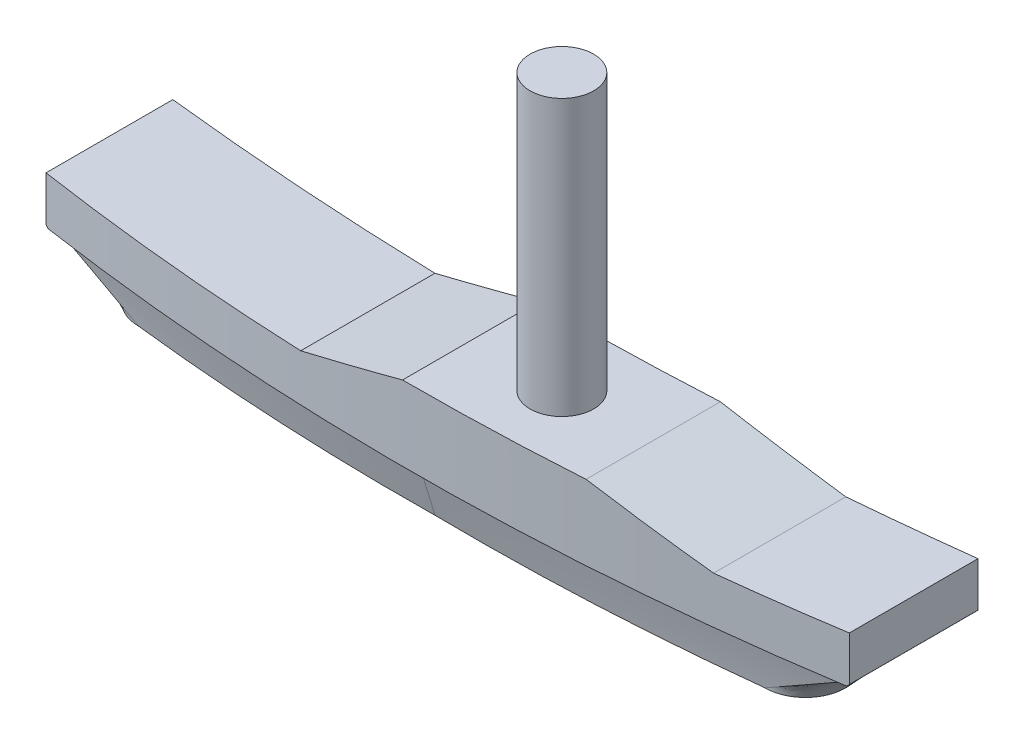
ISO-10303-21;
HEADER;
FILE_DESCRIPTION(('STEP AP214'),'2;1');
FILE_NAME('part.step','',(''),(''),'','','');
FILE_SCHEMA(('AUTOMOTIVE_DESIGN { 1 0 10303 214 1 1 1 1 }'));
ENDSEC;
DATA;
#1=APPLICATION_CONTEXT('core data for automotive mechanical design processes');
#2=APPLICATION_PROTOCOL_DEFINITION('international standard','automotive_design',2000,#1);
#3=PRODUCT_CONTEXT('',#1,'mechanical');
#4=PRODUCT('Part','Part','',(#3));
#5=PRODUCT_RELATED_PRODUCT_CATEGORY('part','',(#4));
#6=PRODUCT_DEFINITION_FORMATION('','',#4);
#7=PRODUCT_DEFINITION_CONTEXT('part definition',#1,'design');
#8=PRODUCT_DEFINITION('design','',#6,#7);
#9=PRODUCT_DEFINITION_SHAPE('','',#8);
#10=(LENGTH_UNIT() NAMED_UNIT(*) SI_UNIT(.MILLI.,.METRE.));
#11=(NAMED_UNIT(*) PLANE_ANGLE_UNIT() SI_UNIT($,.RADIAN.));
#12=(NAMED_UNIT(*) SI_UNIT($,.STERADIAN.) SOLID_ANGLE_UNIT());
#13=UNCERTAINTY_MEASURE_WITH_UNIT(LENGTH_MEASURE(1.E-05),#10,'distance_accuracy_value','');
#14=(GEOMETRIC_REPRESENTATION_CONTEXT(3) GLOBAL_UNCERTAINTY_ASSIGNED_CONTEXT((#13)) GLOBAL_UNIT_ASSIGNED_CONTEXT((#10,
#11,#12)) REPRESENTATION_CONTEXT('',''));
#15=CARTESIAN_POINT('',(0.,0.,0.));
#16=DIRECTION('',(0.,0.,1.));
#17=DIRECTION('',(1.,0.,0.));
#18=AXIS2_PLACEMENT_3D('',#15,#16,#17);
#19=CARTESIAN_POINT('',(89.4617446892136,128.447272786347,-41.));
#20=DIRECTION('',(0.,1.,0.));
#21=DIRECTION('',(0.,0.,1.));
#22=AXIS2_PLACEMENT_3D('',#19,#20,#21);
#23=PLANE('',#22);
#24=DIRECTION('',(0.,0.,1.));
#25=VECTOR('',#24,1.);
#26=CARTESIAN_POINT('',(89.4617446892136,128.447272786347,-41.));
#27=LINE('',#26,#25);
#28=CARTESIAN_POINT('',(89.4617446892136,128.447272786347,-34.2392456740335));
#29=VERTEX_POINT('',#28);
#30=CARTESIAN_POINT('',(89.4617446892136,128.447272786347,-9.71667776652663));
#31=VERTEX_POINT('',#30);
#32=EDGE_CURVE('E258',#29,#31,#27,.T.);
#33=ORIENTED_EDGE('',*,*,#32,.T.);
#34=CARTESIAN_POINT('',(90.2256837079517,128.447272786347,-487.581419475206));
#35=DIRECTION('',(0.,1.,0.));
#36=DIRECTION('',(0.,0.,1.));
#37=AXIS2_PLACEMENT_3D('',#34,#35,#36);
#38=CIRCLE('',#37,477.865352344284);
#39=CARTESIAN_POINT('',(121.725900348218,128.447272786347,-10.7554225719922));
#40=VERTEX_POINT('',#39);
#41=EDGE_CURVE('E228',#40,#31,#38,.F.);
#42=ORIENTED_EDGE('',*,*,#41,.F.);
#43=DIRECTION('',(0.,0.,1.));
#44=VECTOR('',#43,1.);
#45=CARTESIAN_POINT('',(121.725900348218,128.447272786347,-41.));
#46=LINE('',#45,#44);
#47=CARTESIAN_POINT('',(121.725900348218,128.447272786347,-35.1330182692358));
#48=VERTEX_POINT('',#47);
#49=EDGE_CURVE('E261',#48,#40,#46,.T.);
#50=ORIENTED_EDGE('',*,*,#49,.F.);
#51=CARTESIAN_POINT('',(88.1460786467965,128.447272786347,-664.5294804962));
#52=DIRECTION('',(0.,1.,0.));
#53=DIRECTION('',(0.,0.,1.));
#54=AXIS2_PLACEMENT_3D('',#51,#52,#53);
#55=CIRCLE('',#54,630.291607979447);
#56=EDGE_CURVE('E246',#29,#48,#55,.T.);
#57=ORIENTED_EDGE('',*,*,#56,.F.);
#58=EDGE_LOOP('',(#33,#42,#50,#57));
#59=FACE_BOUND('',#58,.T.);
#60=CARTESIAN_POINT('',(105.593822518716,128.447272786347,-22.4973341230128));
#61=DIRECTION('',(0.,1.,0.));
#62=DIRECTION('',(0.,0.,1.));
#63=AXIS2_PLACEMENT_3D('',#60,#61,#62);
#64=CIRCLE('',#63,5.77113497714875);
#65=CARTESIAN_POINT('',(105.593822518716,128.447272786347,-16.7261991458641));
#66=VERTEX_POINT('',#65);
#67=EDGE_CURVE('E547',#66,#66,#64,.T.);
#68=ORIENTED_EDGE('',*,*,#67,.F.);
#69=EDGE_LOOP('',(#68));
#70=FACE_BOUND('',#69,.T.);
#71=ADVANCED_FACE('F38',(#59,#70),#23,.T.);
#72=CARTESIAN_POINT('',(28.1748364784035,106.857743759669,-40.));
#73=DIRECTION('',(-0.697545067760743,-0.716540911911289,0.));
#74=DIRECTION('',(0.716540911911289,-0.697545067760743,0.));
#75=AXIS2_PLACEMENT_3D('',#72,#73,#74);
#76=PLANE('',#75);
#77=DIRECTION('',(0.,0.,-1.));
#78=VECTOR('',#77,1.);
#79=CARTESIAN_POINT('',(19.956977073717,114.857743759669,-40.));
#80=LINE('',#79,#78);
#81=CARTESIAN_POINT('',(19.956977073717,114.857743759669,-14.9107055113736));
#82=VERTEX_POINT('',#81);
#83=CARTESIAN_POINT('',(19.956977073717,114.857743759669,-37.9373025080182));
#84=VERTEX_POINT('',#83);
#85=EDGE_CURVE('E206',#82,#84,#80,.T.);
#86=ORIENTED_EDGE('',*,*,#85,.F.);
#87=CARTESIAN_POINT('',(90.2256837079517,46.4518943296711,-487.581419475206));
#88=DIRECTION('',(-0.697545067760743,-0.716540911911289,0.));
#89=DIRECTION('',(0.716540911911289,-0.697545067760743,0.));
#90=AXIS2_PLACEMENT_3D('',#87,#88,#89);
#91=ELLIPSE('',#90,666.905886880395,477.865352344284);
#92=CARTESIAN_POINT('',(19.503823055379,115.298884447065,-14.9782948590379));
#93=VERTEX_POINT('',#92);
#94=EDGE_CURVE('E217',#93,#82,#91,.F.);
#95=ORIENTED_EDGE('',*,*,#94,.F.);
#96=DIRECTION('',(0.,0.,1.));
#97=VECTOR('',#96,1.);
#98=CARTESIAN_POINT('',(19.503823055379,115.298884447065,-40.));
#99=LINE('',#98,#97);
#100=CARTESIAN_POINT('',(19.503823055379,115.298884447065,-37.9867829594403));
#101=VERTEX_POINT('',#100);
#102=EDGE_CURVE('E46',#101,#93,#99,.T.);
#103=ORIENTED_EDGE('',*,*,#102,.F.);
#104=CARTESIAN_POINT('',(88.1460786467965,48.4763680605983,-664.5294804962));
#105=DIRECTION('',(-0.697545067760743,-0.716540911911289,0.));
#106=DIRECTION('',(0.716540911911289,-0.697545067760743,0.));
#107=AXIS2_PLACEMENT_3D('',#104,#105,#106);
#108=ELLIPSE('',#107,879.631012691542,630.291607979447);
#109=EDGE_CURVE('E215',#84,#101,#108,.T.);
#110=ORIENTED_EDGE('',*,*,#109,.F.);
#111=EDGE_LOOP('',(#86,#95,#103,#110));
#112=FACE_BOUND('',#111,.T.);
#113=ADVANCED_FACE('F40',(#112),#76,.T.);
#114=CARTESIAN_POINT('',(164.696110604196,115.298884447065,-40.));
#115=DIRECTION('',(0.716540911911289,-0.697545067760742,0.));
#116=DIRECTION('',(0.697545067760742,0.716540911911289,0.));
#117=AXIS2_PLACEMENT_3D('',#114,#115,#116);
#118=PLANE('',#117);
#119=DIRECTION('',(0.,0.,1.));
#120=VECTOR('',#119,1.);
#121=CARTESIAN_POINT('',(164.266664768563,114.857743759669,-40.));
#122=LINE('',#121,#120);
#123=CARTESIAN_POINT('',(164.266664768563,114.857743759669,-38.8513144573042));
#124=VERTEX_POINT('',#123);
#125=CARTESIAN_POINT('',(164.266664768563,114.857743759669,-15.4869076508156));
#126=VERTEX_POINT('',#125);
#127=EDGE_CURVE('E60',#124,#126,#122,.T.);
#128=ORIENTED_EDGE('',*,*,#127,.F.);
#129=CARTESIAN_POINT('',(88.1460786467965,36.6642094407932,-664.5294804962));
#130=DIRECTION('',(0.716540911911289,-0.697545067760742,0.));
#131=DIRECTION('',(-0.697545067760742,-0.716540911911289,0.));
#132=AXIS2_PLACEMENT_3D('',#129,#130,#131);
#133=ELLIPSE('',#132,903.585498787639,630.291607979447);
#134=CARTESIAN_POINT('',(164.696110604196,115.298884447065,-38.9037108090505));
#135=VERTEX_POINT('',#134);
#136=EDGE_CURVE('E210',#135,#124,#133,.T.);
#137=ORIENTED_EDGE('',*,*,#136,.F.);
#138=DIRECTION('',(0.,0.,1.));
#139=VECTOR('',#138,1.);
#140=CARTESIAN_POINT('',(164.696110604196,115.298884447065,-40.));
#141=LINE('',#140,#139);
#142=CARTESIAN_POINT('',(164.696110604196,115.298884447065,-15.5544599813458));
#143=VERTEX_POINT('',#142);
#144=EDGE_CURVE('E254',#135,#143,#141,.T.);
#145=ORIENTED_EDGE('',*,*,#144,.T.);
#146=CARTESIAN_POINT('',(90.2256837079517,38.8004471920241,-487.581419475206));
#147=DIRECTION('',(0.716540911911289,-0.697545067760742,0.));
#148=DIRECTION('',(-0.697545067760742,-0.716540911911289,0.));
#149=AXIS2_PLACEMENT_3D('',#146,#147,#148);
#150=ELLIPSE('',#149,685.067351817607,477.865352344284);
#151=EDGE_CURVE('E213',#126,#143,#150,.F.);
#152=ORIENTED_EDGE('',*,*,#151,.F.);
#153=EDGE_LOOP('',(#128,#137,#145,#152));
#154=FACE_BOUND('',#153,.T.);
#155=ADVANCED_FACE('F279',(#154),#118,.T.);
#156=CARTESIAN_POINT('',(164.696110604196,123.392059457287,-41.));
#157=DIRECTION('',(1.,0.,0.));
#158=DIRECTION('',(0.,0.,-1.));
#159=AXIS2_PLACEMENT_3D('',#156,#157,#158);
#160=PLANE('',#159);
#161=DIRECTION('',(0.,0.,1.));
#162=VECTOR('',#161,1.);
#163=CARTESIAN_POINT('',(164.696110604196,123.392059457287,-41.));
#164=LINE('',#163,#162);
#165=CARTESIAN_POINT('',(164.696110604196,123.392059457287,-38.9037108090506));
#166=VERTEX_POINT('',#165);
#167=CARTESIAN_POINT('',(164.696110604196,123.392059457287,-15.5544599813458));
#168=VERTEX_POINT('',#167);
#169=EDGE_CURVE('E250',#166,#168,#164,.T.);
#170=ORIENTED_EDGE('',*,*,#169,.T.);
#171=DIRECTION('',(0.,-1.,0.));
#172=VECTOR('',#171,1.);
#173=CARTESIAN_POINT('',(164.696110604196,128.448272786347,-15.5544599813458));
#174=LINE('',#173,#172);
#175=EDGE_CURVE('E233',#168,#143,#174,.T.);
#176=ORIENTED_EDGE('',*,*,#175,.T.);
#177=ORIENTED_EDGE('',*,*,#144,.F.);
#178=DIRECTION('',(0.,-1.,0.));
#179=VECTOR('',#178,1.);
#180=CARTESIAN_POINT('',(164.696110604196,128.448272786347,-38.9037108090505));
#181=LINE('',#180,#179);
#182=EDGE_CURVE('E237',#166,#135,#181,.T.);
#183=ORIENTED_EDGE('',*,*,#182,.F.);
#184=EDGE_LOOP('',(#170,#176,#177,#183));
#185=FACE_BOUND('',#184,.T.);
#186=ADVANCED_FACE('F282',(#185),#160,.T.);
#187=CARTESIAN_POINT('',(19.503823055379,115.298884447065,-41.));
#188=DIRECTION('',(-1.,0.,0.));
#189=DIRECTION('',(0.,-1.,0.));
#190=AXIS2_PLACEMENT_3D('',#187,#188,#189);
#191=PLANE('',#190);
#192=ORIENTED_EDGE('',*,*,#102,.T.);
#193=DIRECTION('',(0.,-1.,0.));
#194=VECTOR('',#193,1.);
#195=CARTESIAN_POINT('',(19.503823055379,128.448272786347,-14.9782948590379));
#196=LINE('',#195,#194);
#197=CARTESIAN_POINT('',(19.503823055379,123.392059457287,-14.9782948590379));
#198=VERTEX_POINT('',#197);
#199=EDGE_CURVE('E232',#198,#93,#196,.T.);
#200=ORIENTED_EDGE('',*,*,#199,.F.);
#201=DIRECTION('',(0.,0.,1.));
#202=VECTOR('',#201,1.);
#203=CARTESIAN_POINT('',(19.503823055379,123.392059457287,-41.));
#204=LINE('',#203,#202);
#205=CARTESIAN_POINT('',(19.503823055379,123.392059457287,-37.9867829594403));
#206=VERTEX_POINT('',#205);
#207=EDGE_CURVE('E251',#206,#198,#204,.T.);
#208=ORIENTED_EDGE('',*,*,#207,.F.);
#209=DIRECTION('',(0.,-1.,0.));
#210=VECTOR('',#209,1.);
#211=CARTESIAN_POINT('',(19.503823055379,128.448272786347,-37.9867829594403));
#212=LINE('',#211,#210);
#213=EDGE_CURVE('E239',#206,#101,#212,.T.);
#214=ORIENTED_EDGE('',*,*,#213,.T.);
#215=EDGE_LOOP('',(#192,#200,#208,#214));
#216=FACE_BOUND('',#215,.T.);
#217=ADVANCED_FACE('F313',(#216),#191,.T.);
#218=CARTESIAN_POINT('',(19.503823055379,123.392059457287,-41.));
#219=DIRECTION('',(0.,1.,0.));
#220=DIRECTION('',(0.,0.,1.));
#221=AXIS2_PLACEMENT_3D('',#218,#219,#220);
#222=PLANE('',#221);
#223=ORIENTED_EDGE('',*,*,#207,.T.);
#224=CARTESIAN_POINT('',(90.2256837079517,123.392059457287,-487.581419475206));
#225=DIRECTION('',(0.,1.,0.));
#226=DIRECTION('',(0.,0.,1.));
#227=AXIS2_PLACEMENT_3D('',#224,#225,#226);
#228=CIRCLE('',#227,477.865352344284);
#229=CARTESIAN_POINT('',(70.5790360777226,123.392059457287,-10.1201077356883));
#230=VERTEX_POINT('',#229);
#231=EDGE_CURVE('E222',#230,#198,#228,.F.);
#232=ORIENTED_EDGE('',*,*,#231,.F.);
#233=DIRECTION('',(0.,0.,1.));
#234=VECTOR('',#233,1.);
#235=CARTESIAN_POINT('',(70.5790360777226,123.392059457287,-41.));
#236=LINE('',#235,#234);
#237=CARTESIAN_POINT('',(70.5790360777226,123.392059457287,-34.482728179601));
#238=VERTEX_POINT('',#237);
#239=EDGE_CURVE('E255',#238,#230,#236,.T.);
#240=ORIENTED_EDGE('',*,*,#239,.F.);
#241=CARTESIAN_POINT('',(88.1460786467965,123.392059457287,-664.5294804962));
#242=DIRECTION('',(0.,1.,0.));
#243=DIRECTION('',(0.,0.,1.));
#244=AXIS2_PLACEMENT_3D('',#241,#242,#243);
#245=CIRCLE('',#244,630.291607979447);
#246=EDGE_CURVE('E220',#206,#238,#245,.T.);
#247=ORIENTED_EDGE('',*,*,#246,.F.);
#248=EDGE_LOOP('',(#223,#232,#240,#247));
#249=FACE_BOUND('',#248,.T.);
#250=ADVANCED_FACE('F309',(#249),#222,.T.);
#251=CARTESIAN_POINT('',(70.5790360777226,123.392059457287,-41.));
#252=DIRECTION('',(-0.25860935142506,0.965981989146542,0.));
#253=DIRECTION('',(-0.965981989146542,-0.25860935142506,0.));
#254=AXIS2_PLACEMENT_3D('',#251,#252,#253);
#255=PLANE('',#254);
#256=ORIENTED_EDGE('',*,*,#239,.T.);
#257=CARTESIAN_POINT('',(90.2256837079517,128.651791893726,-487.581419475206));
#258=DIRECTION('',(-0.25860935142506,0.965981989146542,0.));
#259=DIRECTION('',(-0.965981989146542,-0.25860935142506,0.));
#260=AXIS2_PLACEMENT_3D('',#257,#258,#259);
#261=ELLIPSE('',#260,494.693853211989,477.865352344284);
#262=EDGE_CURVE('E230',#31,#230,#261,.F.);
#263=ORIENTED_EDGE('',*,*,#262,.F.);
#264=ORIENTED_EDGE('',*,*,#32,.F.);
#265=CARTESIAN_POINT('',(88.1460786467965,128.095047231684,-664.5294804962));
#266=DIRECTION('',(-0.25860935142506,0.965981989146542,0.));
#267=DIRECTION('',(-0.965981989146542,-0.25860935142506,0.));
#268=AXIS2_PLACEMENT_3D('',#265,#266,#267);
#269=ELLIPSE('',#268,652.48795014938,630.291607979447);
#270=EDGE_CURVE('E248',#238,#29,#269,.T.);
#271=ORIENTED_EDGE('',*,*,#270,.F.);
#272=EDGE_LOOP('',(#256,#263,#264,#271));
#273=FACE_BOUND('',#272,.T.);
#274=ADVANCED_FACE('F304',(#273),#255,.T.);
#275=CARTESIAN_POINT('',(121.725900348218,128.447272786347,-41.));
#276=DIRECTION('',(0.231313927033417,0.972879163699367,0.));
#277=DIRECTION('',(-0.972879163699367,0.231313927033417,0.));
#278=AXIS2_PLACEMENT_3D('',#275,#276,#277);
#279=PLANE('',#278);
#280=ORIENTED_EDGE('',*,*,#49,.T.);
#281=CARTESIAN_POINT('',(90.2256837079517,135.936834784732,-487.581419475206));
#282=DIRECTION('',(0.231313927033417,0.972879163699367,0.));
#283=DIRECTION('',(0.972879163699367,-0.231313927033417,0.));
#284=AXIS2_PLACEMENT_3D('',#281,#282,#283);
#285=ELLIPSE('',#284,491.186747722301,477.865352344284);
#286=CARTESIAN_POINT('',(142.987532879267,123.392059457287,-12.6377572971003));
#287=VERTEX_POINT('',#286);
#288=EDGE_CURVE('E226',#287,#40,#285,.F.);
#289=ORIENTED_EDGE('',*,*,#288,.F.);
#290=DIRECTION('',(0.,0.,1.));
#291=VECTOR('',#290,1.);
#292=CARTESIAN_POINT('',(142.987532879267,123.392059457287,-41.));
#293=LINE('',#292,#291);
#294=CARTESIAN_POINT('',(142.987532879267,123.392059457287,-36.628273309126));
#295=VERTEX_POINT('',#294);
#296=EDGE_CURVE('E264',#295,#287,#293,.T.);
#297=ORIENTED_EDGE('',*,*,#296,.F.);
#298=CARTESIAN_POINT('',(88.1460786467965,136.431286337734,-664.5294804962));
#299=DIRECTION('',(0.231313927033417,0.972879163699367,0.));
#300=DIRECTION('',(0.972879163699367,-0.231313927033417,0.));
#301=AXIS2_PLACEMENT_3D('',#298,#299,#300);
#302=ELLIPSE('',#301,647.862171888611,630.291607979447);
#303=EDGE_CURVE('E244',#48,#295,#302,.T.);
#304=ORIENTED_EDGE('',*,*,#303,.F.);
#305=EDGE_LOOP('',(#280,#289,#297,#304));
#306=FACE_BOUND('',#305,.T.);
#307=ADVANCED_FACE('F294',(#306),#279,.T.);
#308=CARTESIAN_POINT('',(142.987532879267,123.392059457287,-41.));
#309=DIRECTION('',(0.,1.,0.));
#310=DIRECTION('',(0.,0.,1.));
#311=AXIS2_PLACEMENT_3D('',#308,#309,#310);
#312=PLANE('',#311);
#313=ORIENTED_EDGE('',*,*,#296,.T.);
#314=CARTESIAN_POINT('',(90.2256837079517,123.392059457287,-487.581419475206));
#315=DIRECTION('',(0.,1.,0.));
#316=DIRECTION('',(0.,0.,1.));
#317=AXIS2_PLACEMENT_3D('',#314,#315,#316);
#318=CIRCLE('',#317,477.865352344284);
#319=EDGE_CURVE('E224',#168,#287,#318,.F.);
#320=ORIENTED_EDGE('',*,*,#319,.F.);
#321=ORIENTED_EDGE('',*,*,#169,.F.);
#322=CARTESIAN_POINT('',(88.1460786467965,123.392059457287,-664.5294804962));
#323=DIRECTION('',(0.,1.,0.));
#324=DIRECTION('',(0.,0.,1.));
#325=AXIS2_PLACEMENT_3D('',#322,#323,#324);
#326=CIRCLE('',#325,630.291607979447);
#327=EDGE_CURVE('E236',#295,#166,#326,.T.);
#328=ORIENTED_EDGE('',*,*,#327,.F.);
#329=EDGE_LOOP('',(#313,#320,#321,#328));
#330=FACE_BOUND('',#329,.T.);
#331=ADVANCED_FACE('F289',(#330),#312,.T.);
#332=CARTESIAN_POINT('',(88.1460786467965,128.448272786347,-664.5294804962));
#333=DIRECTION('',(0.,-1.,0.));
#334=DIRECTION('',(1.,0.,0.));
#335=AXIS2_PLACEMENT_3D('',#332,#333,#334);
#336=CYLINDRICAL_SURFACE('',#335,630.291607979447);
#337=CARTESIAN_POINT('',(88.1460786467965,114.857743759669,-664.5294804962));
#338=DIRECTION('',(0.,1.,0.));
#339=DIRECTION('',(-1.,0.,0.));
#340=AXIS2_PLACEMENT_3D('',#337,#338,#339);
#341=CIRCLE('',#340,630.291607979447);
#342=EDGE_CURVE('E208',#84,#124,#341,.T.);
#343=ORIENTED_EDGE('',*,*,#342,.F.);
#344=ORIENTED_EDGE('',*,*,#109,.T.);
#345=ORIENTED_EDGE('',*,*,#213,.F.);
#346=ORIENTED_EDGE('',*,*,#246,.T.);
#347=ORIENTED_EDGE('',*,*,#270,.T.);
#348=ORIENTED_EDGE('',*,*,#56,.T.);
#349=ORIENTED_EDGE('',*,*,#303,.T.);
#350=ORIENTED_EDGE('',*,*,#327,.T.);
#351=ORIENTED_EDGE('',*,*,#182,.T.);
#352=ORIENTED_EDGE('',*,*,#136,.T.);
#353=EDGE_LOOP('',(#343,#344,#345,#346,#347,#348,#349,#350,#351,#352));
#354=FACE_BOUND('',#353,.T.);
#355=ADVANCED_FACE('F321',(#354),#336,.F.);
#356=CARTESIAN_POINT('',(90.2256837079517,128.448272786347,-487.581419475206));
#357=DIRECTION('',(0.,-1.,0.));
#358=DIRECTION('',(1.,0.,0.));
#359=AXIS2_PLACEMENT_3D('',#356,#357,#358);
#360=CYLINDRICAL_SURFACE('',#359,477.865352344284);
#361=CARTESIAN_POINT('',(90.2256837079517,114.857743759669,-487.581419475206));
#362=DIRECTION('',(0.,1.,0.));
#363=DIRECTION('',(-1.,0.,0.));
#364=AXIS2_PLACEMENT_3D('',#361,#362,#363);
#365=CIRCLE('',#364,477.865352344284);
#366=EDGE_CURVE('E12',#126,#82,#365,.F.);
#367=ORIENTED_EDGE('',*,*,#366,.F.);
#368=ORIENTED_EDGE('',*,*,#151,.T.);
#369=ORIENTED_EDGE('',*,*,#175,.F.);
#370=ORIENTED_EDGE('',*,*,#319,.T.);
#371=ORIENTED_EDGE('',*,*,#288,.T.);
#372=ORIENTED_EDGE('',*,*,#41,.T.);
#373=ORIENTED_EDGE('',*,*,#262,.T.);
#374=ORIENTED_EDGE('',*,*,#231,.T.);
#375=ORIENTED_EDGE('',*,*,#199,.T.);
#376=ORIENTED_EDGE('',*,*,#94,.T.);
#377=EDGE_LOOP('',(#367,#368,#369,#370,#371,#372,#373,#374,#375,#376));
#378=FACE_BOUND('',#377,.T.);
#379=ADVANCED_FACE('F286',(#378),#360,.T.);
#380=CARTESIAN_POINT('',(8.4284544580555,114.857743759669,8.59458058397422));
#381=DIRECTION('',(0.,1.,0.));
#382=DIRECTION('',(-1.,0.,0.));
#383=AXIS2_PLACEMENT_3D('',#380,#381,#382);
#384=PLANE('',#383);
#385=DIRECTION('',(0.,0.,-1.));
#386=VECTOR('',#385,1.);
#387=CARTESIAN_POINT('',(20.503823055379,114.857743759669,-15.840572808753));
#388=LINE('',#387,#386);
#389=CARTESIAN_POINT('',(20.503823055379,114.857743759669,-15.840572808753));
#390=VERTEX_POINT('',#389);
#391=CARTESIAN_POINT('',(20.503823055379,114.857743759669,-36.8722336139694));
#392=VERTEX_POINT('',#391);
#393=EDGE_CURVE('E156',#390,#392,#388,.T.);
#394=ORIENTED_EDGE('',*,*,#393,.F.);
#395=CARTESIAN_POINT('',(90.2256837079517,114.857743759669,-487.581419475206));
#396=DIRECTION('',(0.,-1.,0.));
#397=DIRECTION('',(-1.,0.,0.));
#398=AXIS2_PLACEMENT_3D('',#395,#396,#397);
#399=CIRCLE('',#398,476.865352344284);
#400=CARTESIAN_POINT('',(91.8352158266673,114.857743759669,-10.7187834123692));
#401=VERTEX_POINT('',#400);
#402=EDGE_CURVE('E166',#401,#390,#399,.T.);
#403=ORIENTED_EDGE('',*,*,#402,.F.);
#404=CARTESIAN_POINT('',(163.696110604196,114.857743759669,-16.4098364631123));
#405=VERTEX_POINT('',#404);
#406=EDGE_CURVE('E171',#405,#401,#399,.T.);
#407=ORIENTED_EDGE('',*,*,#406,.F.);
#408=DIRECTION('',(0.,0.,1.));
#409=VECTOR('',#408,1.);
#410=CARTESIAN_POINT('',(163.696110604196,114.857743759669,-16.4098364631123));
#411=LINE('',#410,#409);
#412=CARTESIAN_POINT('',(163.696110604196,114.857743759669,-37.7749137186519));
#413=VERTEX_POINT('',#412);
#414=EDGE_CURVE('E185',#413,#405,#411,.T.);
#415=ORIENTED_EDGE('',*,*,#414,.F.);
#416=CARTESIAN_POINT('',(88.1460786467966,114.857743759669,-664.529480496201));
#417=DIRECTION('',(0.,1.,0.));
#418=DIRECTION('',(-1.,0.,0.));
#419=AXIS2_PLACEMENT_3D('',#416,#417,#418);
#420=CIRCLE('',#419,631.291607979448);
#421=CARTESIAN_POINT('',(91.8391258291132,114.857743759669,-33.2486747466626));
#422=VERTEX_POINT('',#421);
#423=EDGE_CURVE('E180',#422,#413,#420,.T.);
#424=ORIENTED_EDGE('',*,*,#423,.F.);
#425=EDGE_CURVE('E53',#392,#422,#420,.T.);
#426=ORIENTED_EDGE('',*,*,#425,.F.);
#427=EDGE_LOOP('',(#394,#403,#407,#415,#424,#426));
#428=FACE_BOUND('',#427,.T.);
#429=ORIENTED_EDGE('',*,*,#342,.T.);
#430=ORIENTED_EDGE('',*,*,#127,.T.);
#431=ORIENTED_EDGE('',*,*,#366,.T.);
#432=ORIENTED_EDGE('',*,*,#85,.T.);
#433=EDGE_LOOP('',(#429,#430,#431,#432));
#434=FACE_BOUND('',#433,.T.);
#435=ADVANCED_FACE('F174',(#428,#434),#384,.F.);
#436=CARTESIAN_POINT('',(92.3029104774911,106.85774375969,-465.750662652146));
#437=DIRECTION('',(0.,1.,0.));
#438=DIRECTION('',(-1.,0.,0.));
#439=AXIS2_PLACEMENT_3D('',#436,#437,#438);
#440=PLANE('',#439);
#441=CARTESIAN_POINT('',(105.649988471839,106.85774375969,-22.3863500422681));
#442=DIRECTION('',(0.,-1.,0.));
#443=DIRECTION('',(1.,0.,0.));
#444=AXIS2_PLACEMENT_3D('',#441,#442,#443);
#445=CIRCLE('',#444,1.29851496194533);
#446=CARTESIAN_POINT('',(106.948503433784,106.85774375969,-22.3863500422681));
#447=VERTEX_POINT('',#446);
#448=EDGE_CURVE('E548',#447,#447,#445,.T.);
#449=ORIENTED_EDGE('',*,*,#448,.F.);
#450=EDGE_LOOP('',(#449));
#451=FACE_BOUND('',#450,.T.);
#452=CARTESIAN_POINT('',(86.2829924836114,106.85774375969,-465.753360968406));
#453=DIRECTION('',(0.,-1.,0.));
#454=DIRECTION('',(-1.,0.,0.));
#455=AXIS2_PLACEMENT_3D('',#452,#453,#454);
#456=CIRCLE('',#455,452.80541776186);
#457=CARTESIAN_POINT('',(92.0999668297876,106.85774375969,-12.9853086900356));
#458=VERTEX_POINT('',#457);
#459=CARTESIAN_POINT('',(35.5155345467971,106.85774375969,-15.8029020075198));
#460=VERTEX_POINT('',#459);
#461=EDGE_CURVE('E193',#458,#460,#456,.T.);
#462=ORIENTED_EDGE('',*,*,#461,.T.);
#463=CARTESIAN_POINT('',(35.5009792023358,106.85774375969,-23.1290258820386));
#464=DIRECTION('',(0.,-1.,0.));
#465=DIRECTION('',(1.,0.,0.));
#466=AXIS2_PLACEMENT_3D('',#463,#464,#465);
#467=CIRCLE('',#466,7.32613833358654);
#468=CARTESIAN_POINT('',(35.5438618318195,106.85774375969,-30.4550431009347));
#469=VERTEX_POINT('',#468);
#470=EDGE_CURVE('E157',#460,#469,#467,.T.);
#471=ORIENTED_EDGE('',*,*,#470,.T.);
#472=CARTESIAN_POINT('',(117.527094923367,106.85774375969,2823.67346396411));
#473=DIRECTION('',(0.,-1.,0.));
#474=DIRECTION('',(1.,0.,0.));
#475=AXIS2_PLACEMENT_3D('',#472,#473,#474);
#476=CIRCLE('',#475,2855.30572537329);
#477=CARTESIAN_POINT('',(92.0999668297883,106.85774375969,-31.5190420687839));
#478=VERTEX_POINT('',#477);
#479=EDGE_CURVE('E198',#469,#478,#476,.T.);
#480=ORIENTED_EDGE('',*,*,#479,.T.);
#481=CARTESIAN_POINT('',(67.3266992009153,106.85774375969,2823.6792120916));
#482=DIRECTION('',(0.,-1.,0.));
#483=DIRECTION('',(-1.,0.,0.));
#484=AXIS2_PLACEMENT_3D('',#481,#482,#483);
#485=CIRCLE('',#484,2855.30572537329);
#486=CARTESIAN_POINT('',(149.109727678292,106.85774375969,-30.4550387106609));
#487=VERTEX_POINT('',#486);
#488=EDGE_CURVE('E200',#478,#487,#485,.T.);
#489=ORIENTED_EDGE('',*,*,#488,.T.);
#490=CARTESIAN_POINT('',(149.152610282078,106.85774375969,-23.1290258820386));
#491=DIRECTION('',(0.,-1.,0.));
#492=DIRECTION('',(-1.,0.,0.));
#493=AXIS2_PLACEMENT_3D('',#490,#491,#492);
#494=CIRCLE('',#493,7.32613833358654);
#495=CARTESIAN_POINT('',(149.138054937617,106.85774375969,-15.8029020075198));
#496=VERTEX_POINT('',#495);
#497=EDGE_CURVE('E197',#487,#496,#494,.T.);
#498=ORIENTED_EDGE('',*,*,#497,.T.);
#499=CARTESIAN_POINT('',(98.3228284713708,106.85774375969,-465.747964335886));
#500=DIRECTION('',(0.,-1.,0.));
#501=DIRECTION('',(1.,0.,0.));
#502=AXIS2_PLACEMENT_3D('',#499,#500,#501);
#503=CIRCLE('',#502,452.80541776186);
#504=EDGE_CURVE('E195',#496,#458,#503,.T.);
#505=ORIENTED_EDGE('',*,*,#504,.T.);
#506=EDGE_LOOP('',(#462,#471,#480,#489,#498,#505));
#507=FACE_BOUND('',#506,.T.);
#508=ADVANCED_FACE('F394',(#451,#507),#440,.F.);
#509=CARTESIAN_POINT('',(35.5155350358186,106.85774375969,-15.8029063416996));
#510=CARTESIAN_POINT('',(20.503823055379,114.857743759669,-15.840572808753));
#511=CARTESIAN_POINT('',(54.3058485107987,106.85774375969,-13.6828141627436));
#512=CARTESIAN_POINT('',(44.13033972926,114.857743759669,-12.348645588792));
#513=CARTESIAN_POINT('',(73.1919880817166,106.85774375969,-12.7423868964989));
#514=CARTESIAN_POINT('',(67.9521811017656,114.857743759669,-10.6381721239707));
#515=CARTESIAN_POINT('',(92.0999668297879,106.85774375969,-12.9853086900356));
#516=CARTESIAN_POINT('',(91.8352158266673,114.857743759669,-10.7187834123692));
#517=(BOUNDED_SURFACE() B_SPLINE_SURFACE(3,1,((#509,#510),(#511,#512),(#513,#514),(#515,#516)),
.UNSPECIFIED.,.F.,.F.,.F.) B_SPLINE_SURFACE_WITH_KNOTS((4,4),(2,2),(0.,1.),(0.,1.),
.UNSPECIFIED.) GEOMETRIC_REPRESENTATION_ITEM() RATIONAL_B_SPLINE_SURFACE(((1.,1.),
(0.998694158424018,0.998123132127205),(0.998694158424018,0.998123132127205),(1.,1.))) REPRESENTATION_ITEM('') SURFACE());
#518=DIRECTION('',(-0.0318245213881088,0.961643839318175,0.272448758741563));
#519=VECTOR('',#518,1.);
#520=CARTESIAN_POINT('',(91.9675913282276,110.85774375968,-11.8520460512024));
#521=LINE('',#520,#519);
#522=EDGE_CURVE('E161',#458,#401,#521,.T.);
#523=DIRECTION('',(0.882503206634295,-0.470301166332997,0.00221432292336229));
#524=VECTOR('',#523,1.);
#525=CARTESIAN_POINT('',(28.0096790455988,110.85774375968,-15.8217395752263));
#526=LINE('',#525,#524);
#527=EDGE_CURVE('E151',#390,#460,#526,.T.);
#528=ORIENTED_EDGE('',*,*,#461,.F.);
#529=ORIENTED_EDGE('',*,*,#522,.T.);
#530=ORIENTED_EDGE('',*,*,#402,.T.);
#531=ORIENTED_EDGE('',*,*,#527,.T.);
#532=EDGE_LOOP('',(#528,#529,#530,#531));
#533=FACE_BOUND('',#532,.T.);
#534=ADVANCED_FACE('F167',(#533),#517,.T.);
#535=CARTESIAN_POINT('',(92.0999668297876,106.85774375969,-12.9853086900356));
#536=CARTESIAN_POINT('',(91.8352158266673,114.857743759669,-10.7187834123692));
#537=CARTESIAN_POINT('',(111.15933708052,106.85774375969,-12.7233528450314));
#538=CARTESIAN_POINT('',(115.909620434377,114.857743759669,-10.8000406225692));
#539=CARTESIAN_POINT('',(130.197293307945,106.85774375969,-13.6637984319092));
#540=CARTESIAN_POINT('',(139.909018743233,114.857743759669,-12.7006828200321));
#541=CARTESIAN_POINT('',(149.138054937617,106.85774375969,-15.8029020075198));
#542=CARTESIAN_POINT('',(163.696110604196,114.857743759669,-16.4098364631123));
#543=(BOUNDED_SURFACE() B_SPLINE_SURFACE(3,1,((#535,#536),(#537,#538),(#539,#540),(#541,#542)),
.UNSPECIFIED.,.F.,.F.,.F.) B_SPLINE_SURFACE_WITH_KNOTS((4,4),(2,2),(0.,1.),(0.,1.),
.UNSPECIFIED.) GEOMETRIC_REPRESENTATION_ITEM() RATIONAL_B_SPLINE_SURFACE(((1.,1.),
(0.998673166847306,0.998093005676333),(0.998673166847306,0.998093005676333),(1.,1.))) REPRESENTATION_ITEM('') SURFACE());
#544=DIRECTION('',(0.875807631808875,0.481277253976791,-0.036512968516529));
#545=VECTOR('',#544,1.);
#546=CARTESIAN_POINT('',(156.417082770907,110.85774375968,-16.1063692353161));
#547=LINE('',#546,#545);
#548=EDGE_CURVE('E162',#496,#405,#547,.T.);
#549=ORIENTED_EDGE('',*,*,#504,.F.);
#550=ORIENTED_EDGE('',*,*,#548,.T.);
#551=ORIENTED_EDGE('',*,*,#406,.T.);
#552=ORIENTED_EDGE('',*,*,#522,.F.);
#553=EDGE_LOOP('',(#549,#550,#551,#552));
#554=FACE_BOUND('',#553,.T.);
#555=ADVANCED_FACE('F412',(#554),#543,.T.);
#556=CARTESIAN_POINT('',(35.5438618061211,106.85774375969,-30.4550387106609));
#557=CARTESIAN_POINT('',(20.503823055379,114.857743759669,-36.8722336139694));
#558=CARTESIAN_POINT('',(31.2390321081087,106.85774375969,-30.4802369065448));
#559=CARTESIAN_POINT('',(20.503823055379,114.857743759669,-33.3669568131));
#560=CARTESIAN_POINT('',(28.1831772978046,106.85774375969,-27.4480850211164));
#561=CARTESIAN_POINT('',(20.503823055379,114.857743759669,-29.8616800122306));
#562=CARTESIAN_POINT('',(28.166531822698,106.85774375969,-18.8382942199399));
#563=CARTESIAN_POINT('',(20.503823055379,114.857743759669,-22.8511264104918));
#564=CARTESIAN_POINT('',(31.2106395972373,106.85774375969,-15.7943491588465));
#565=CARTESIAN_POINT('',(20.503823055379,114.857743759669,-19.3458496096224));
#566=CARTESIAN_POINT('',(35.5155345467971,106.85774375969,-15.8029020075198));
#567=CARTESIAN_POINT('',(20.503823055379,114.857743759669,-15.840572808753));
#568=(BOUNDED_SURFACE() B_SPLINE_SURFACE(3,1,((#556,#557),(#558,#559),(#560,#561),(#562,#563),
(#564,#565),(#566,#567)),.UNSPECIFIED.,.F.,.F.,.F.) B_SPLINE_SURFACE_WITH_KNOTS((4,2,4),(2,2),
(0.,0.5,1.),(0.,1.),
.UNSPECIFIED.) GEOMETRIC_REPRESENTATION_ITEM() RATIONAL_B_SPLINE_SURFACE(((1.,1.),
(0.646115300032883,1.),(0.519355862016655,1.),(0.519355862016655,1.),(0.646115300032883,1.),(1.,1.))) REPRESENTATION_ITEM('') SURFACE());
#569=DIRECTION('',(0.826197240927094,-0.439465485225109,0.35251695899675));
#570=VECTOR('',#569,1.);
#571=CARTESIAN_POINT('',(28.0238424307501,110.857743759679,-33.6636361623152));
#572=LINE('',#571,#570);
#573=EDGE_CURVE('E189',#392,#469,#572,.T.);
#574=ORIENTED_EDGE('',*,*,#470,.F.);
#575=ORIENTED_EDGE('',*,*,#527,.F.);
#576=ORIENTED_EDGE('',*,*,#393,.T.);
#577=ORIENTED_EDGE('',*,*,#573,.T.);
#578=EDGE_LOOP('',(#574,#575,#576,#577));
#579=FACE_BOUND('',#578,.T.);
#580=ADVANCED_FACE('F153',(#579),#568,.T.);
#581=CARTESIAN_POINT('',(149.138054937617,106.85774375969,-15.8029020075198));
#582=CARTESIAN_POINT('',(163.696110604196,114.857743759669,-16.4098364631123));
#583=CARTESIAN_POINT('',(153.442949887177,106.85774375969,-15.7943491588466));
#584=CARTESIAN_POINT('',(163.696110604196,114.857743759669,-19.9706826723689));
#585=CARTESIAN_POINT('',(156.487057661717,106.85774375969,-18.8382942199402));
#586=CARTESIAN_POINT('',(163.696110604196,114.857743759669,-23.5315288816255));
#587=CARTESIAN_POINT('',(156.470412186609,106.85774375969,-27.4480850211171));
#588=CARTESIAN_POINT('',(163.696110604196,114.857743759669,-30.6532213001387));
#589=CARTESIAN_POINT('',(153.414557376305,106.85774375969,-30.4802369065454));
#590=CARTESIAN_POINT('',(163.696110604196,114.857743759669,-34.2140675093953));
#591=CARTESIAN_POINT('',(149.109727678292,106.85774375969,-30.4550387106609));
#592=CARTESIAN_POINT('',(163.696110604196,114.857743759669,-37.7749137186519));
#593=(BOUNDED_SURFACE() B_SPLINE_SURFACE(3,1,((#581,#582),(#583,#584),(#585,#586),(#587,#588),
(#589,#590),(#591,#592)),.UNSPECIFIED.,.F.,.F.,.F.) B_SPLINE_SURFACE_WITH_KNOTS((4,2,4),(2,2),
(0.,0.5,1.),(0.,1.),
.UNSPECIFIED.) GEOMETRIC_REPRESENTATION_ITEM() RATIONAL_B_SPLINE_SURFACE(((1.,1.),
(0.646115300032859,1.),(0.519355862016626,1.),(0.519355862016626,1.),(0.646115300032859,1.),(1.,1.))) REPRESENTATION_ITEM('') SURFACE());
#594=DIRECTION('',(0.802536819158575,0.440156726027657,-0.402736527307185));
#595=VECTOR('',#594,1.);
#596=CARTESIAN_POINT('',(156.402919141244,110.85774375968,-34.1149762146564));
#597=LINE('',#596,#595);
#598=EDGE_CURVE('E178',#487,#413,#597,.T.);
#599=ORIENTED_EDGE('',*,*,#497,.F.);
#600=ORIENTED_EDGE('',*,*,#598,.T.);
#601=ORIENTED_EDGE('',*,*,#414,.T.);
#602=ORIENTED_EDGE('',*,*,#548,.F.);
#603=EDGE_LOOP('',(#599,#600,#601,#602));
#604=FACE_BOUND('',#603,.T.);
#605=ADVANCED_FACE('F431',(#604),#593,.T.);
#606=CARTESIAN_POINT('',(92.0999668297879,106.85774375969,-31.5190420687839));
#607=CARTESIAN_POINT('',(91.8391258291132,114.857743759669,-33.2486747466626));
#608=CARTESIAN_POINT('',(73.2447268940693,106.85774375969,-31.3511253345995));
#609=CARTESIAN_POINT('',(68.004994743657,114.857743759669,-33.1092430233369));
#610=CARTESIAN_POINT('',(54.3920752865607,106.85774375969,-30.9964474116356));
#611=CARTESIAN_POINT('',(44.2011459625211,114.857743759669,-34.3183869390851));
#612=CARTESIAN_POINT('',(35.5438618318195,106.85774375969,-30.4550431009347));
#613=CARTESIAN_POINT('',(20.503823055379,114.857743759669,-36.8722336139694));
#614=(BOUNDED_SURFACE() B_SPLINE_SURFACE(3,1,((#606,#607),(#608,#609),(#610,#611),(#612,#613)),
.UNSPECIFIED.,.F.,.F.,.F.) B_SPLINE_SURFACE_WITH_KNOTS((4,4),(2,2),(0.,1.),(0.,1.),
.UNSPECIFIED.) GEOMETRIC_REPRESENTATION_ITEM() RATIONAL_B_SPLINE_SURFACE(((1.,1.),
(0.999967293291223,0.998932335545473),(0.999967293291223,0.998932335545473),(1.,1.))) REPRESENTATION_ITEM('') SURFACE());
#615=DIRECTION('',(0.0318526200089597,-0.976920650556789,0.211214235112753));
#616=VECTOR('',#615,1.);
#617=CARTESIAN_POINT('',(91.9695463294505,110.85774375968,-32.3838584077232));
#618=LINE('',#617,#616);
#619=EDGE_CURVE('E176',#422,#478,#618,.T.);
#620=ORIENTED_EDGE('',*,*,#479,.F.);
#621=ORIENTED_EDGE('',*,*,#573,.F.);
#622=ORIENTED_EDGE('',*,*,#425,.T.);
#623=ORIENTED_EDGE('',*,*,#619,.T.);
#624=EDGE_LOOP('',(#620,#621,#622,#623));
#625=FACE_BOUND('',#624,.T.);
#626=ADVANCED_FACE('F440',(#625),#614,.T.);
#627=CARTESIAN_POINT('',(149.109727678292,106.85774375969,-30.4550387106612));
#628=CARTESIAN_POINT('',(163.696110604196,114.857743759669,-37.7749137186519));
#629=CARTESIAN_POINT('',(130.110331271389,106.85774375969,-30.9994518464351));
#630=CARTESIAN_POINT('',(139.842919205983,114.857743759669,-34.8996105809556));
#631=CARTESIAN_POINT('',(111.106446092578,106.85774375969,-31.3541314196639));
#632=CARTESIAN_POINT('',(115.864578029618,114.857743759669,-33.3892257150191));
#633=CARTESIAN_POINT('',(92.0999668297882,106.85774375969,-31.5190420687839));
#634=CARTESIAN_POINT('',(91.8391258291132,114.857743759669,-33.2486747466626));
#635=(BOUNDED_SURFACE() B_SPLINE_SURFACE(3,1,((#627,#628),(#629,#630),(#631,#632),(#633,#634)),
.UNSPECIFIED.,.F.,.F.,.F.) B_SPLINE_SURFACE_WITH_KNOTS((4,4),(2,2),(0.,1.),(0.,1.),
.UNSPECIFIED.) GEOMETRIC_REPRESENTATION_ITEM() RATIONAL_B_SPLINE_SURFACE(((1.,1.),
(0.999966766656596,0.998915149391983),(0.999966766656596,0.998915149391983),(1.,1.))) REPRESENTATION_ITEM('') SURFACE());
#636=ORIENTED_EDGE('',*,*,#488,.F.);
#637=ORIENTED_EDGE('',*,*,#619,.F.);
#638=ORIENTED_EDGE('',*,*,#423,.T.);
#639=ORIENTED_EDGE('',*,*,#598,.F.);
#640=EDGE_LOOP('',(#636,#637,#638,#639));
#641=FACE_BOUND('',#640,.T.);
#642=ADVANCED_FACE('F404',(#641),#635,.T.);
#643=CARTESIAN_POINT('',(105.593822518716,178.447272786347,-22.4973341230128));
#644=DIRECTION('',(0.,-1.,0.));
#645=DIRECTION('',(0.,0.,-1.));
#646=AXIS2_PLACEMENT_3D('',#643,#644,#645);
#647=CYLINDRICAL_SURFACE('',#646,5.77113497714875);
#648=CARTESIAN_POINT('',(105.593822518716,178.447272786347,-22.4973341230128));
#649=DIRECTION('',(0.,1.,0.));
#650=DIRECTION('',(0.,0.,1.));
#651=AXIS2_PLACEMENT_3D('',#648,#649,#650);
#652=CIRCLE('',#651,5.77113497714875);
#653=CARTESIAN_POINT('',(105.593822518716,178.447272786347,-16.7261991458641));
#654=VERTEX_POINT('',#653);
#655=EDGE_CURVE('E172',#654,#654,#652,.T.);
#656=ORIENTED_EDGE('',*,*,#655,.F.);
#657=EDGE_LOOP('',(#656));
#658=FACE_BOUND('',#657,.T.);
#659=ORIENTED_EDGE('',*,*,#67,.T.);
#660=EDGE_LOOP('',(#659));
#661=FACE_BOUND('',#660,.T.);
#662=ADVANCED_FACE('F414',(#658,#661),#647,.T.);
#663=CARTESIAN_POINT('',(105.593822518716,178.447272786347,-22.4973341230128));
#664=DIRECTION('',(0.,1.,0.));
#665=DIRECTION('',(0.,0.,1.));
#666=AXIS2_PLACEMENT_3D('',#663,#664,#665);
#667=PLANE('',#666);
#668=ORIENTED_EDGE('',*,*,#655,.T.);
#669=EDGE_LOOP('',(#668));
#670=FACE_BOUND('',#669,.T.);
#671=ADVANCED_FACE('F468',(#670),#667,.T.);
#672=CARTESIAN_POINT('',(105.649988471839,107.85774375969,-22.3863500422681));
#673=DIRECTION('',(0.,-1.,0.));
#674=DIRECTION('',(1.,0.,0.));
#675=AXIS2_PLACEMENT_3D('',#672,#673,#674);
#676=CYLINDRICAL_SURFACE('',#675,1.29851496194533);
#677=CARTESIAN_POINT('',(105.649988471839,107.85774375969,-22.3863500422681));
#678=DIRECTION('',(0.,-1.,0.));
#679=DIRECTION('',(1.,0.,0.));
#680=AXIS2_PLACEMENT_3D('',#677,#678,#679);
#681=CIRCLE('',#680,1.29851496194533);
#682=CARTESIAN_POINT('',(106.948503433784,107.85774375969,-22.3863500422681));
#683=VERTEX_POINT('',#682);
#684=EDGE_CURVE('E546',#683,#683,#681,.T.);
#685=ORIENTED_EDGE('',*,*,#684,.F.);
#686=EDGE_LOOP('',(#685));
#687=FACE_BOUND('',#686,.T.);
#688=ORIENTED_EDGE('',*,*,#448,.T.);
#689=EDGE_LOOP('',(#688));
#690=FACE_BOUND('',#689,.T.);
#691=ADVANCED_FACE('F478',(#687,#690),#676,.F.);
#692=CARTESIAN_POINT('',(105.649988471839,107.85774375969,-22.3863500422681));
#693=DIRECTION('',(0.,-1.,0.));
#694=DIRECTION('',(1.,0.,0.));
#695=AXIS2_PLACEMENT_3D('',#692,#693,#694);
#696=PLANE('',#695);
#697=ORIENTED_EDGE('',*,*,#684,.T.);
#698=EDGE_LOOP('',(#697));
#699=FACE_BOUND('',#698,.T.);
#700=ADVANCED_FACE('F488',(#699),#696,.T.);
#701=CLOSED_SHELL('',(#71,#113,#155,#186,#217,#250,#274,#307,#331,#355,#379,#435,#508,#534,#555,
#580,#605,#626,#642,#662,#671,#691,#700));
#702=MANIFOLD_SOLID_BREP('B2',#701);
#703=ADVANCED_BREP_SHAPE_REPRESENTATION('',(#18,#702),#14);
#704=SHAPE_DEFINITION_REPRESENTATION(#9,#703);
ENDSEC;
END-ISO-10303-21;
